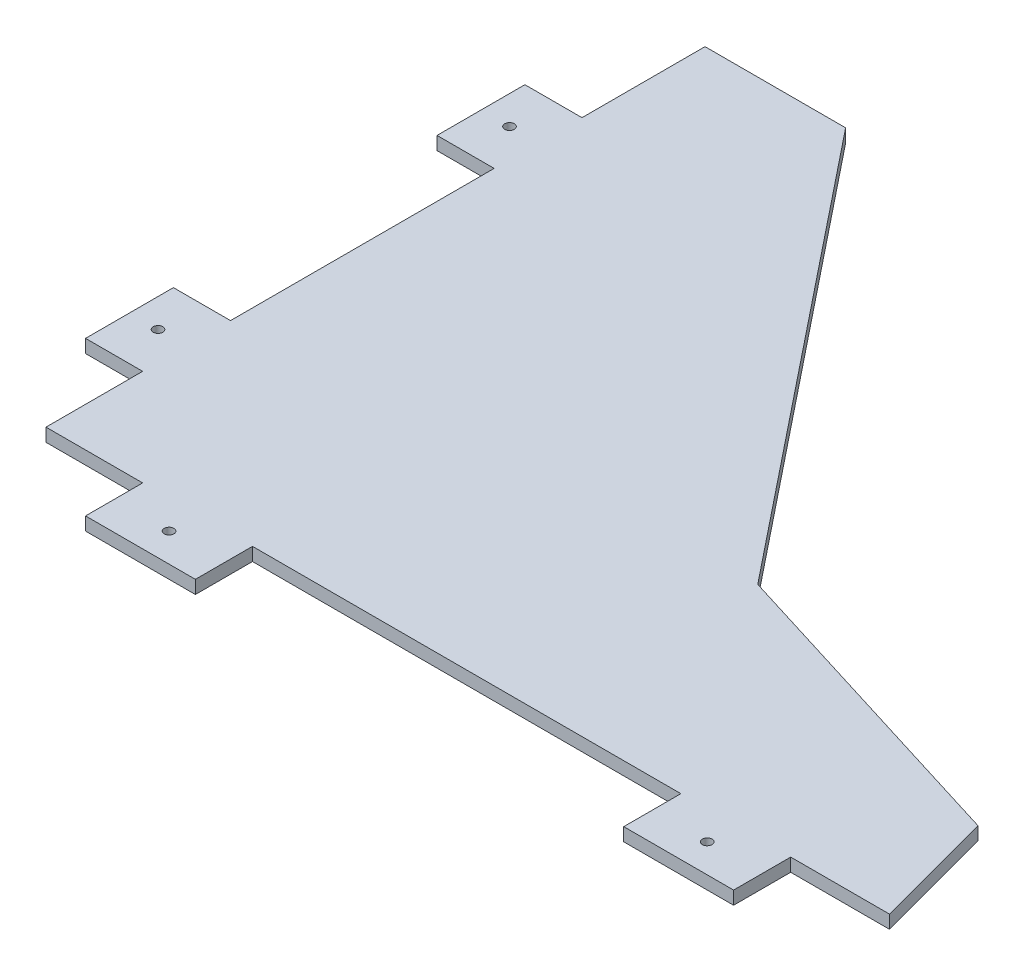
ISO-10303-21;
HEADER;
FILE_DESCRIPTION(('STEP AP214'),'2;1');
FILE_NAME('part.step','',(''),(''),'','','');
FILE_SCHEMA(('AUTOMOTIVE_DESIGN { 1 0 10303 214 1 1 1 1 }'));
ENDSEC;
DATA;
#1=APPLICATION_CONTEXT('core data for automotive mechanical design processes');
#2=APPLICATION_PROTOCOL_DEFINITION('international standard','automotive_design',2000,#1);
#3=PRODUCT_CONTEXT('',#1,'mechanical');
#4=PRODUCT('Part','Part','',(#3));
#5=PRODUCT_RELATED_PRODUCT_CATEGORY('part','',(#4));
#6=PRODUCT_DEFINITION_FORMATION('','',#4);
#7=PRODUCT_DEFINITION_CONTEXT('part definition',#1,'design');
#8=PRODUCT_DEFINITION('design','',#6,#7);
#9=PRODUCT_DEFINITION_SHAPE('','',#8);
#10=(LENGTH_UNIT() NAMED_UNIT(*) SI_UNIT(.MILLI.,.METRE.));
#11=(NAMED_UNIT(*) PLANE_ANGLE_UNIT() SI_UNIT($,.RADIAN.));
#12=(NAMED_UNIT(*) SI_UNIT($,.STERADIAN.) SOLID_ANGLE_UNIT());
#13=UNCERTAINTY_MEASURE_WITH_UNIT(LENGTH_MEASURE(1.E-05),#10,'distance_accuracy_value','');
#14=(GEOMETRIC_REPRESENTATION_CONTEXT(3) GLOBAL_UNCERTAINTY_ASSIGNED_CONTEXT((#13)) GLOBAL_UNIT_ASSIGNED_CONTEXT((#10,
#11,#12)) REPRESENTATION_CONTEXT('',''));
#15=CARTESIAN_POINT('',(0.,0.,0.));
#16=DIRECTION('',(0.,0.,1.));
#17=DIRECTION('',(1.,0.,0.));
#18=AXIS2_PLACEMENT_3D('',#15,#16,#17);
#19=CARTESIAN_POINT('',(0.,6.,0.));
#20=DIRECTION('',(0.,-1.,0.));
#21=DIRECTION('',(0.,0.,-1.));
#22=AXIS2_PLACEMENT_3D('',#19,#20,#21);
#23=PLANE('',#22);
#24=CARTESIAN_POINT('',(-123.,6.,163.));
#25=DIRECTION('',(0.,1.,0.));
#26=DIRECTION('',(0.,0.,1.));
#27=AXIS2_PLACEMENT_3D('',#24,#25,#26);
#28=CIRCLE('',#27,2.2);
#29=CARTESIAN_POINT('',(-123.,6.,165.2));
#30=VERTEX_POINT('',#29);
#31=EDGE_CURVE('E422',#30,#30,#28,.T.);
#32=ORIENTED_EDGE('',*,*,#31,.F.);
#33=EDGE_LOOP('',(#32));
#34=FACE_BOUND('',#33,.T.);
#35=CARTESIAN_POINT('',(-205.,6.,-74.));
#36=DIRECTION('',(0.,1.,0.));
#37=DIRECTION('',(0.,0.,1.));
#38=AXIS2_PLACEMENT_3D('',#35,#36,#37);
#39=CIRCLE('',#38,2.20000000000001);
#40=CARTESIAN_POINT('',(-205.,6.,-71.8));
#41=VERTEX_POINT('',#40);
#42=EDGE_CURVE('E218',#41,#41,#39,.T.);
#43=ORIENTED_EDGE('',*,*,#42,.F.);
#44=EDGE_LOOP('',(#43));
#45=FACE_BOUND('',#44,.T.);
#46=DIRECTION('',(-1.,0.,0.));
#47=VECTOR('',#46,1.);
#48=CARTESIAN_POINT('',(-192.,6.,-150.));
#49=LINE('',#48,#47);
#50=CARTESIAN_POINT('',(-128.,6.,-150.));
#51=VERTEX_POINT('',#50);
#52=CARTESIAN_POINT('',(-192.,6.,-150.));
#53=VERTEX_POINT('',#52);
#54=EDGE_CURVE('E257',#51,#53,#49,.T.);
#55=ORIENTED_EDGE('',*,*,#54,.T.);
#56=DIRECTION('',(0.,0.,1.));
#57=VECTOR('',#56,1.);
#58=CARTESIAN_POINT('',(-192.,6.,-150.));
#59=LINE('',#58,#57);
#60=CARTESIAN_POINT('',(-192.,6.,-94.));
#61=VERTEX_POINT('',#60);
#62=EDGE_CURVE('E135',#53,#61,#59,.T.);
#63=ORIENTED_EDGE('',*,*,#62,.T.);
#64=DIRECTION('',(-1.,0.,0.));
#65=VECTOR('',#64,1.);
#66=CARTESIAN_POINT('',(-192.,6.,-94.));
#67=LINE('',#66,#65);
#68=CARTESIAN_POINT('',(-218.,6.,-94.));
#69=VERTEX_POINT('',#68);
#70=EDGE_CURVE('E314',#61,#69,#67,.T.);
#71=ORIENTED_EDGE('',*,*,#70,.T.);
#72=DIRECTION('',(0.,0.,1.));
#73=VECTOR('',#72,1.);
#74=CARTESIAN_POINT('',(-218.,6.,-54.));
#75=LINE('',#74,#73);
#76=CARTESIAN_POINT('',(-218.,6.,-54.));
#77=VERTEX_POINT('',#76);
#78=EDGE_CURVE('E333',#69,#77,#75,.T.);
#79=ORIENTED_EDGE('',*,*,#78,.T.);
#80=DIRECTION('',(1.,0.,0.));
#81=VECTOR('',#80,1.);
#82=CARTESIAN_POINT('',(-192.,6.,-54.));
#83=LINE('',#82,#81);
#84=CARTESIAN_POINT('',(-192.,6.,-54.));
#85=VERTEX_POINT('',#84);
#86=EDGE_CURVE('E330',#77,#85,#83,.T.);
#87=ORIENTED_EDGE('',*,*,#86,.T.);
#88=DIRECTION('',(0.,0.,1.));
#89=VECTOR('',#88,1.);
#90=CARTESIAN_POINT('',(-192.,6.,-54.));
#91=LINE('',#90,#89);
#92=CARTESIAN_POINT('',(-192.,6.,66.));
#93=VERTEX_POINT('',#92);
#94=EDGE_CURVE('E332',#85,#93,#91,.T.);
#95=ORIENTED_EDGE('',*,*,#94,.T.);
#96=DIRECTION('',(-1.,0.,0.));
#97=VECTOR('',#96,1.);
#98=CARTESIAN_POINT('',(-192.,6.,66.));
#99=LINE('',#98,#97);
#100=CARTESIAN_POINT('',(-218.,6.,66.));
#101=VERTEX_POINT('',#100);
#102=EDGE_CURVE('E335',#93,#101,#99,.T.);
#103=ORIENTED_EDGE('',*,*,#102,.T.);
#104=DIRECTION('',(0.,0.,1.));
#105=VECTOR('',#104,1.);
#106=CARTESIAN_POINT('',(-218.,6.,106.));
#107=LINE('',#106,#105);
#108=CARTESIAN_POINT('',(-218.,6.,106.));
#109=VERTEX_POINT('',#108);
#110=EDGE_CURVE('E341',#101,#109,#107,.T.);
#111=ORIENTED_EDGE('',*,*,#110,.T.);
#112=DIRECTION('',(1.,0.,0.));
#113=VECTOR('',#112,1.);
#114=CARTESIAN_POINT('',(-192.,6.,106.));
#115=LINE('',#114,#113);
#116=CARTESIAN_POINT('',(-192.,6.,106.));
#117=VERTEX_POINT('',#116);
#118=EDGE_CURVE('E343',#109,#117,#115,.T.);
#119=ORIENTED_EDGE('',*,*,#118,.T.);
#120=DIRECTION('',(0.,0.,1.));
#121=VECTOR('',#120,1.);
#122=CARTESIAN_POINT('',(-192.,6.,106.));
#123=LINE('',#122,#121);
#124=CARTESIAN_POINT('',(-192.,6.,150.));
#125=VERTEX_POINT('',#124);
#126=EDGE_CURVE('E345',#117,#125,#123,.T.);
#127=ORIENTED_EDGE('',*,*,#126,.T.);
#128=DIRECTION('',(1.,0.,0.));
#129=VECTOR('',#128,1.);
#130=CARTESIAN_POINT('',(-192.,6.,150.));
#131=LINE('',#130,#129);
#132=CARTESIAN_POINT('',(-148.,6.,150.));
#133=VERTEX_POINT('',#132);
#134=EDGE_CURVE('E347',#125,#133,#131,.T.);
#135=ORIENTED_EDGE('',*,*,#134,.T.);
#136=DIRECTION('',(0.,0.,1.));
#137=VECTOR('',#136,1.);
#138=CARTESIAN_POINT('',(-148.,6.,150.));
#139=LINE('',#138,#137);
#140=CARTESIAN_POINT('',(-148.,6.,176.));
#141=VERTEX_POINT('',#140);
#142=EDGE_CURVE('E349',#133,#141,#139,.T.);
#143=ORIENTED_EDGE('',*,*,#142,.T.);
#144=DIRECTION('',(1.,0.,0.));
#145=VECTOR('',#144,1.);
#146=CARTESIAN_POINT('',(-148.,6.,176.));
#147=LINE('',#146,#145);
#148=CARTESIAN_POINT('',(-98.,6.,176.));
#149=VERTEX_POINT('',#148);
#150=EDGE_CURVE('E351',#141,#149,#147,.T.);
#151=ORIENTED_EDGE('',*,*,#150,.T.);
#152=DIRECTION('',(0.,0.,-1.));
#153=VECTOR('',#152,1.);
#154=CARTESIAN_POINT('',(-98.,6.,150.));
#155=LINE('',#154,#153);
#156=CARTESIAN_POINT('',(-98.,6.,150.));
#157=VERTEX_POINT('',#156);
#158=EDGE_CURVE('E353',#149,#157,#155,.T.);
#159=ORIENTED_EDGE('',*,*,#158,.T.);
#160=DIRECTION('',(1.,0.,0.));
#161=VECTOR('',#160,1.);
#162=CARTESIAN_POINT('',(-98.,6.,150.));
#163=LINE('',#162,#161);
#164=CARTESIAN_POINT('',(97.,6.,150.));
#165=VERTEX_POINT('',#164);
#166=EDGE_CURVE('E355',#157,#165,#163,.T.);
#167=ORIENTED_EDGE('',*,*,#166,.T.);
#168=DIRECTION('',(0.,0.,1.));
#169=VECTOR('',#168,1.);
#170=CARTESIAN_POINT('',(97.,6.,150.));
#171=LINE('',#170,#169);
#172=CARTESIAN_POINT('',(97.,6.,176.));
#173=VERTEX_POINT('',#172);
#174=EDGE_CURVE('E357',#165,#173,#171,.T.);
#175=ORIENTED_EDGE('',*,*,#174,.T.);
#176=DIRECTION('',(1.,0.,0.));
#177=VECTOR('',#176,1.);
#178=CARTESIAN_POINT('',(97.,6.,176.));
#179=LINE('',#178,#177);
#180=CARTESIAN_POINT('',(147.,6.,176.));
#181=VERTEX_POINT('',#180);
#182=EDGE_CURVE('E359',#173,#181,#179,.T.);
#183=ORIENTED_EDGE('',*,*,#182,.T.);
#184=DIRECTION('',(0.,0.,-1.));
#185=VECTOR('',#184,1.);
#186=CARTESIAN_POINT('',(147.,6.,150.));
#187=LINE('',#186,#185);
#188=CARTESIAN_POINT('',(147.,6.,150.));
#189=VERTEX_POINT('',#188);
#190=EDGE_CURVE('E361',#181,#189,#187,.T.);
#191=ORIENTED_EDGE('',*,*,#190,.T.);
#192=DIRECTION('',(1.,0.,0.));
#193=VECTOR('',#192,1.);
#194=CARTESIAN_POINT('',(147.,6.,150.));
#195=LINE('',#194,#193);
#196=CARTESIAN_POINT('',(192.,6.,150.));
#197=VERTEX_POINT('',#196);
#198=EDGE_CURVE('E196',#189,#197,#195,.T.);
#199=ORIENTED_EDGE('',*,*,#198,.T.);
#200=DIRECTION('',(-0.258819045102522,0.,-0.965925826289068));
#201=VECTOR('',#200,1.);
#202=CARTESIAN_POINT('',(177.262794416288,6.,95.));
#203=LINE('',#202,#201);
#204=CARTESIAN_POINT('',(177.262794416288,6.,95.));
#205=VERTEX_POINT('',#204);
#206=EDGE_CURVE('E190',#197,#205,#203,.T.);
#207=ORIENTED_EDGE('',*,*,#206,.T.);
#208=DIRECTION('',(-0.95521582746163,0.,-0.295909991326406));
#209=VECTOR('',#208,1.);
#210=CARTESIAN_POINT('',(32.0000000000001,6.,50.));
#211=LINE('',#210,#209);
#212=CARTESIAN_POINT('',(32.0000000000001,6.,50.));
#213=VERTEX_POINT('',#212);
#214=EDGE_CURVE('E194',#205,#213,#211,.T.);
#215=ORIENTED_EDGE('',*,*,#214,.T.);
#216=DIRECTION('',(-0.624695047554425,0.,-0.78086880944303));
#217=VECTOR('',#216,1.);
#218=CARTESIAN_POINT('',(-128.,6.,-150.));
#219=LINE('',#218,#217);
#220=EDGE_CURVE('E50',#213,#51,#219,.T.);
#221=ORIENTED_EDGE('',*,*,#220,.T.);
#222=EDGE_LOOP('',(#55,#63,#71,#79,#87,#95,#103,#111,#119,#127,#135,#143,#151,#159,#167,#175,
#183,#191,#199,#207,#215,#221));
#223=FACE_BOUND('',#222,.T.);
#224=CARTESIAN_POINT('',(-205.,6.,86.));
#225=DIRECTION('',(0.,1.,0.));
#226=DIRECTION('',(0.,0.,1.));
#227=AXIS2_PLACEMENT_3D('',#224,#225,#226);
#228=CIRCLE('',#227,2.20000000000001);
#229=CARTESIAN_POINT('',(-205.,6.,88.2));
#230=VERTEX_POINT('',#229);
#231=EDGE_CURVE('E428',#230,#230,#228,.T.);
#232=ORIENTED_EDGE('',*,*,#231,.F.);
#233=EDGE_LOOP('',(#232));
#234=FACE_BOUND('',#233,.T.);
#235=CARTESIAN_POINT('',(122.,6.,163.));
#236=DIRECTION('',(0.,1.,0.));
#237=DIRECTION('',(0.,0.,1.));
#238=AXIS2_PLACEMENT_3D('',#235,#236,#237);
#239=CIRCLE('',#238,2.2);
#240=CARTESIAN_POINT('',(122.,6.,165.2));
#241=VERTEX_POINT('',#240);
#242=EDGE_CURVE('E413',#241,#241,#239,.T.);
#243=ORIENTED_EDGE('',*,*,#242,.F.);
#244=EDGE_LOOP('',(#243));
#245=FACE_BOUND('',#244,.T.);
#246=ADVANCED_FACE('F33',(#34,#45,#223,#234,#245),#23,.F.);
#247=CARTESIAN_POINT('',(0.,0.,0.));
#248=DIRECTION('',(0.,-1.,0.));
#249=DIRECTION('',(0.,0.,-1.));
#250=AXIS2_PLACEMENT_3D('',#247,#248,#249);
#251=PLANE('',#250);
#252=CARTESIAN_POINT('',(-123.,0.,163.));
#253=DIRECTION('',(0.,1.,0.));
#254=DIRECTION('',(0.,0.,1.));
#255=AXIS2_PLACEMENT_3D('',#252,#253,#254);
#256=CIRCLE('',#255,2.2);
#257=CARTESIAN_POINT('',(-123.,0.,165.2));
#258=VERTEX_POINT('',#257);
#259=EDGE_CURVE('E419',#258,#258,#256,.T.);
#260=ORIENTED_EDGE('',*,*,#259,.T.);
#261=EDGE_LOOP('',(#260));
#262=FACE_BOUND('',#261,.T.);
#263=CARTESIAN_POINT('',(-205.,0.,-74.));
#264=DIRECTION('',(0.,1.,0.));
#265=DIRECTION('',(0.,0.,1.));
#266=AXIS2_PLACEMENT_3D('',#263,#264,#265);
#267=CIRCLE('',#266,2.20000000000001);
#268=CARTESIAN_POINT('',(-205.,0.,-71.8));
#269=VERTEX_POINT('',#268);
#270=EDGE_CURVE('E431',#269,#269,#267,.T.);
#271=ORIENTED_EDGE('',*,*,#270,.T.);
#272=EDGE_LOOP('',(#271));
#273=FACE_BOUND('',#272,.T.);
#274=DIRECTION('',(-1.,0.,0.));
#275=VECTOR('',#274,1.);
#276=CARTESIAN_POINT('',(-192.,0.,-150.));
#277=LINE('',#276,#275);
#278=CARTESIAN_POINT('',(-128.,0.,-150.));
#279=VERTEX_POINT('',#278);
#280=CARTESIAN_POINT('',(-192.,0.,-150.));
#281=VERTEX_POINT('',#280);
#282=EDGE_CURVE('E214',#279,#281,#277,.T.);
#283=ORIENTED_EDGE('',*,*,#282,.F.);
#284=DIRECTION('',(-0.624695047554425,0.,-0.78086880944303));
#285=VECTOR('',#284,1.);
#286=CARTESIAN_POINT('',(-128.,0.,-150.));
#287=LINE('',#286,#285);
#288=CARTESIAN_POINT('',(32.0000000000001,0.,50.));
#289=VERTEX_POINT('',#288);
#290=EDGE_CURVE('E127',#289,#279,#287,.T.);
#291=ORIENTED_EDGE('',*,*,#290,.F.);
#292=DIRECTION('',(-0.95521582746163,0.,-0.295909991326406));
#293=VECTOR('',#292,1.);
#294=CARTESIAN_POINT('',(32.0000000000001,0.,50.));
#295=LINE('',#294,#293);
#296=CARTESIAN_POINT('',(177.262794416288,0.,95.));
#297=VERTEX_POINT('',#296);
#298=EDGE_CURVE('E121',#297,#289,#295,.T.);
#299=ORIENTED_EDGE('',*,*,#298,.F.);
#300=DIRECTION('',(-0.258819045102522,0.,-0.965925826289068));
#301=VECTOR('',#300,1.);
#302=CARTESIAN_POINT('',(177.262794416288,0.,95.));
#303=LINE('',#302,#301);
#304=CARTESIAN_POINT('',(192.,0.,150.));
#305=VERTEX_POINT('',#304);
#306=EDGE_CURVE('E204',#305,#297,#303,.T.);
#307=ORIENTED_EDGE('',*,*,#306,.F.);
#308=DIRECTION('',(1.,0.,0.));
#309=VECTOR('',#308,1.);
#310=CARTESIAN_POINT('',(147.,0.,150.));
#311=LINE('',#310,#309);
#312=CARTESIAN_POINT('',(147.,0.,150.));
#313=VERTEX_POINT('',#312);
#314=EDGE_CURVE('E252',#313,#305,#311,.T.);
#315=ORIENTED_EDGE('',*,*,#314,.F.);
#316=DIRECTION('',(0.,0.,-1.));
#317=VECTOR('',#316,1.);
#318=CARTESIAN_POINT('',(147.,0.,150.));
#319=LINE('',#318,#317);
#320=CARTESIAN_POINT('',(147.,0.,176.));
#321=VERTEX_POINT('',#320);
#322=EDGE_CURVE('E250',#321,#313,#319,.T.);
#323=ORIENTED_EDGE('',*,*,#322,.F.);
#324=DIRECTION('',(1.,0.,0.));
#325=VECTOR('',#324,1.);
#326=CARTESIAN_POINT('',(97.,0.,176.));
#327=LINE('',#326,#325);
#328=CARTESIAN_POINT('',(97.,0.,176.));
#329=VERTEX_POINT('',#328);
#330=EDGE_CURVE('E248',#329,#321,#327,.T.);
#331=ORIENTED_EDGE('',*,*,#330,.F.);
#332=DIRECTION('',(0.,0.,1.));
#333=VECTOR('',#332,1.);
#334=CARTESIAN_POINT('',(97.,0.,150.));
#335=LINE('',#334,#333);
#336=CARTESIAN_POINT('',(97.,0.,150.));
#337=VERTEX_POINT('',#336);
#338=EDGE_CURVE('E246',#337,#329,#335,.T.);
#339=ORIENTED_EDGE('',*,*,#338,.F.);
#340=DIRECTION('',(1.,0.,0.));
#341=VECTOR('',#340,1.);
#342=CARTESIAN_POINT('',(-98.,0.,150.));
#343=LINE('',#342,#341);
#344=CARTESIAN_POINT('',(-98.,0.,150.));
#345=VERTEX_POINT('',#344);
#346=EDGE_CURVE('E244',#345,#337,#343,.T.);
#347=ORIENTED_EDGE('',*,*,#346,.F.);
#348=DIRECTION('',(0.,0.,-1.));
#349=VECTOR('',#348,1.);
#350=CARTESIAN_POINT('',(-98.,0.,150.));
#351=LINE('',#350,#349);
#352=CARTESIAN_POINT('',(-98.,0.,176.));
#353=VERTEX_POINT('',#352);
#354=EDGE_CURVE('E242',#353,#345,#351,.T.);
#355=ORIENTED_EDGE('',*,*,#354,.F.);
#356=DIRECTION('',(1.,0.,0.));
#357=VECTOR('',#356,1.);
#358=CARTESIAN_POINT('',(-148.,0.,176.));
#359=LINE('',#358,#357);
#360=CARTESIAN_POINT('',(-148.,0.,176.));
#361=VERTEX_POINT('',#360);
#362=EDGE_CURVE('E240',#361,#353,#359,.T.);
#363=ORIENTED_EDGE('',*,*,#362,.F.);
#364=DIRECTION('',(0.,0.,1.));
#365=VECTOR('',#364,1.);
#366=CARTESIAN_POINT('',(-148.,0.,150.));
#367=LINE('',#366,#365);
#368=CARTESIAN_POINT('',(-148.,0.,150.));
#369=VERTEX_POINT('',#368);
#370=EDGE_CURVE('E238',#369,#361,#367,.T.);
#371=ORIENTED_EDGE('',*,*,#370,.F.);
#372=DIRECTION('',(1.,0.,0.));
#373=VECTOR('',#372,1.);
#374=CARTESIAN_POINT('',(-192.,0.,150.));
#375=LINE('',#374,#373);
#376=CARTESIAN_POINT('',(-192.,0.,150.));
#377=VERTEX_POINT('',#376);
#378=EDGE_CURVE('E236',#377,#369,#375,.T.);
#379=ORIENTED_EDGE('',*,*,#378,.F.);
#380=DIRECTION('',(0.,0.,1.));
#381=VECTOR('',#380,1.);
#382=CARTESIAN_POINT('',(-192.,0.,106.));
#383=LINE('',#382,#381);
#384=CARTESIAN_POINT('',(-192.,0.,106.));
#385=VERTEX_POINT('',#384);
#386=EDGE_CURVE('E234',#385,#377,#383,.T.);
#387=ORIENTED_EDGE('',*,*,#386,.F.);
#388=DIRECTION('',(1.,0.,0.));
#389=VECTOR('',#388,1.);
#390=CARTESIAN_POINT('',(-192.,0.,106.));
#391=LINE('',#390,#389);
#392=CARTESIAN_POINT('',(-218.,0.,106.));
#393=VERTEX_POINT('',#392);
#394=EDGE_CURVE('E232',#393,#385,#391,.T.);
#395=ORIENTED_EDGE('',*,*,#394,.F.);
#396=DIRECTION('',(0.,0.,1.));
#397=VECTOR('',#396,1.);
#398=CARTESIAN_POINT('',(-218.,0.,106.));
#399=LINE('',#398,#397);
#400=CARTESIAN_POINT('',(-218.,0.,66.));
#401=VERTEX_POINT('',#400);
#402=EDGE_CURVE('E230',#401,#393,#399,.T.);
#403=ORIENTED_EDGE('',*,*,#402,.F.);
#404=DIRECTION('',(-1.,0.,0.));
#405=VECTOR('',#404,1.);
#406=CARTESIAN_POINT('',(-192.,0.,66.));
#407=LINE('',#406,#405);
#408=CARTESIAN_POINT('',(-192.,0.,66.));
#409=VERTEX_POINT('',#408);
#410=EDGE_CURVE('E228',#409,#401,#407,.T.);
#411=ORIENTED_EDGE('',*,*,#410,.F.);
#412=DIRECTION('',(0.,0.,1.));
#413=VECTOR('',#412,1.);
#414=CARTESIAN_POINT('',(-192.,0.,-54.));
#415=LINE('',#414,#413);
#416=CARTESIAN_POINT('',(-192.,0.,-54.));
#417=VERTEX_POINT('',#416);
#418=EDGE_CURVE('E226',#417,#409,#415,.T.);
#419=ORIENTED_EDGE('',*,*,#418,.F.);
#420=DIRECTION('',(1.,0.,0.));
#421=VECTOR('',#420,1.);
#422=CARTESIAN_POINT('',(-192.,0.,-54.));
#423=LINE('',#422,#421);
#424=CARTESIAN_POINT('',(-218.,0.,-54.));
#425=VERTEX_POINT('',#424);
#426=EDGE_CURVE('E224',#425,#417,#423,.T.);
#427=ORIENTED_EDGE('',*,*,#426,.F.);
#428=DIRECTION('',(0.,0.,1.));
#429=VECTOR('',#428,1.);
#430=CARTESIAN_POINT('',(-218.,0.,-54.));
#431=LINE('',#430,#429);
#432=CARTESIAN_POINT('',(-218.,0.,-94.));
#433=VERTEX_POINT('',#432);
#434=EDGE_CURVE('E222',#433,#425,#431,.T.);
#435=ORIENTED_EDGE('',*,*,#434,.F.);
#436=DIRECTION('',(-1.,0.,0.));
#437=VECTOR('',#436,1.);
#438=CARTESIAN_POINT('',(-192.,0.,-94.));
#439=LINE('',#438,#437);
#440=CARTESIAN_POINT('',(-192.,0.,-94.));
#441=VERTEX_POINT('',#440);
#442=EDGE_CURVE('E220',#441,#433,#439,.T.);
#443=ORIENTED_EDGE('',*,*,#442,.F.);
#444=DIRECTION('',(0.,0.,1.));
#445=VECTOR('',#444,1.);
#446=CARTESIAN_POINT('',(-192.,0.,-150.));
#447=LINE('',#446,#445);
#448=EDGE_CURVE('E217',#281,#441,#447,.T.);
#449=ORIENTED_EDGE('',*,*,#448,.F.);
#450=EDGE_LOOP('',(#283,#291,#299,#307,#315,#323,#331,#339,#347,#355,#363,#371,#379,#387,#395,
#403,#411,#419,#427,#435,#443,#449));
#451=FACE_BOUND('',#450,.T.);
#452=CARTESIAN_POINT('',(-205.,0.,86.));
#453=DIRECTION('',(0.,1.,0.));
#454=DIRECTION('',(0.,0.,1.));
#455=AXIS2_PLACEMENT_3D('',#452,#453,#454);
#456=CIRCLE('',#455,2.20000000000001);
#457=CARTESIAN_POINT('',(-205.,0.,88.2));
#458=VERTEX_POINT('',#457);
#459=EDGE_CURVE('E425',#458,#458,#456,.T.);
#460=ORIENTED_EDGE('',*,*,#459,.T.);
#461=EDGE_LOOP('',(#460));
#462=FACE_BOUND('',#461,.T.);
#463=CARTESIAN_POINT('',(122.,0.,163.));
#464=DIRECTION('',(0.,1.,0.));
#465=DIRECTION('',(0.,0.,1.));
#466=AXIS2_PLACEMENT_3D('',#463,#464,#465);
#467=CIRCLE('',#466,2.2);
#468=CARTESIAN_POINT('',(122.,0.,165.2));
#469=VERTEX_POINT('',#468);
#470=EDGE_CURVE('E416',#469,#469,#467,.T.);
#471=ORIENTED_EDGE('',*,*,#470,.T.);
#472=EDGE_LOOP('',(#471));
#473=FACE_BOUND('',#472,.T.);
#474=ADVANCED_FACE('F318',(#262,#273,#451,#462,#473),#251,.T.);
#475=CARTESIAN_POINT('',(-192.,6.,-150.));
#476=DIRECTION('',(0.,0.,1.));
#477=DIRECTION('',(1.,0.,0.));
#478=AXIS2_PLACEMENT_3D('',#475,#476,#477);
#479=PLANE('',#478);
#480=ORIENTED_EDGE('',*,*,#282,.T.);
#481=DIRECTION('',(0.,-1.,0.));
#482=VECTOR('',#481,1.);
#483=CARTESIAN_POINT('',(-192.,6.,-150.));
#484=LINE('',#483,#482);
#485=EDGE_CURVE('E11',#53,#281,#484,.T.);
#486=ORIENTED_EDGE('',*,*,#485,.F.);
#487=ORIENTED_EDGE('',*,*,#54,.F.);
#488=DIRECTION('',(0.,-1.,0.));
#489=VECTOR('',#488,1.);
#490=CARTESIAN_POINT('',(-128.,6.,-150.));
#491=LINE('',#490,#489);
#492=EDGE_CURVE('E210',#51,#279,#491,.T.);
#493=ORIENTED_EDGE('',*,*,#492,.T.);
#494=EDGE_LOOP('',(#480,#486,#487,#493));
#495=FACE_BOUND('',#494,.T.);
#496=ADVANCED_FACE('F35',(#495),#479,.F.);
#497=CARTESIAN_POINT('',(-192.,6.,-150.));
#498=DIRECTION('',(1.,0.,0.));
#499=DIRECTION('',(0.,0.,-1.));
#500=AXIS2_PLACEMENT_3D('',#497,#498,#499);
#501=PLANE('',#500);
#502=ORIENTED_EDGE('',*,*,#448,.T.);
#503=DIRECTION('',(0.,-1.,0.));
#504=VECTOR('',#503,1.);
#505=CARTESIAN_POINT('',(-192.,6.,-94.));
#506=LINE('',#505,#504);
#507=EDGE_CURVE('E42',#61,#441,#506,.T.);
#508=ORIENTED_EDGE('',*,*,#507,.F.);
#509=ORIENTED_EDGE('',*,*,#62,.F.);
#510=ORIENTED_EDGE('',*,*,#485,.T.);
#511=EDGE_LOOP('',(#502,#508,#509,#510));
#512=FACE_BOUND('',#511,.T.);
#513=ADVANCED_FACE('F640',(#512),#501,.F.);
#514=CARTESIAN_POINT('',(-192.,6.,-94.));
#515=DIRECTION('',(0.,0.,1.));
#516=DIRECTION('',(1.,0.,0.));
#517=AXIS2_PLACEMENT_3D('',#514,#515,#516);
#518=PLANE('',#517);
#519=ORIENTED_EDGE('',*,*,#442,.T.);
#520=DIRECTION('',(0.,-1.,0.));
#521=VECTOR('',#520,1.);
#522=CARTESIAN_POINT('',(-218.,6.,-94.));
#523=LINE('',#522,#521);
#524=EDGE_CURVE('E306',#69,#433,#523,.T.);
#525=ORIENTED_EDGE('',*,*,#524,.F.);
#526=ORIENTED_EDGE('',*,*,#70,.F.);
#527=ORIENTED_EDGE('',*,*,#507,.T.);
#528=EDGE_LOOP('',(#519,#525,#526,#527));
#529=FACE_BOUND('',#528,.T.);
#530=ADVANCED_FACE('F312',(#529),#518,.F.);
#531=CARTESIAN_POINT('',(-218.,6.,-54.));
#532=DIRECTION('',(1.,0.,0.));
#533=DIRECTION('',(0.,0.,-1.));
#534=AXIS2_PLACEMENT_3D('',#531,#532,#533);
#535=PLANE('',#534);
#536=ORIENTED_EDGE('',*,*,#434,.T.);
#537=DIRECTION('',(0.,-1.,0.));
#538=VECTOR('',#537,1.);
#539=CARTESIAN_POINT('',(-218.,6.,-54.));
#540=LINE('',#539,#538);
#541=EDGE_CURVE('E303',#77,#425,#540,.T.);
#542=ORIENTED_EDGE('',*,*,#541,.F.);
#543=ORIENTED_EDGE('',*,*,#78,.F.);
#544=ORIENTED_EDGE('',*,*,#524,.T.);
#545=EDGE_LOOP('',(#536,#542,#543,#544));
#546=FACE_BOUND('',#545,.T.);
#547=ADVANCED_FACE('F324',(#546),#535,.F.);
#548=CARTESIAN_POINT('',(-192.,6.,-54.));
#549=DIRECTION('',(0.,0.,-1.));
#550=DIRECTION('',(-1.,0.,0.));
#551=AXIS2_PLACEMENT_3D('',#548,#549,#550);
#552=PLANE('',#551);
#553=ORIENTED_EDGE('',*,*,#426,.T.);
#554=DIRECTION('',(0.,-1.,0.));
#555=VECTOR('',#554,1.);
#556=CARTESIAN_POINT('',(-192.,6.,-54.));
#557=LINE('',#556,#555);
#558=EDGE_CURVE('E300',#85,#417,#557,.T.);
#559=ORIENTED_EDGE('',*,*,#558,.F.);
#560=ORIENTED_EDGE('',*,*,#86,.F.);
#561=ORIENTED_EDGE('',*,*,#541,.T.);
#562=EDGE_LOOP('',(#553,#559,#560,#561));
#563=FACE_BOUND('',#562,.T.);
#564=ADVANCED_FACE('F328',(#563),#552,.F.);
#565=CARTESIAN_POINT('',(-192.,6.,-54.));
#566=DIRECTION('',(1.,0.,0.));
#567=DIRECTION('',(0.,0.,-1.));
#568=AXIS2_PLACEMENT_3D('',#565,#566,#567);
#569=PLANE('',#568);
#570=ORIENTED_EDGE('',*,*,#418,.T.);
#571=DIRECTION('',(0.,-1.,0.));
#572=VECTOR('',#571,1.);
#573=CARTESIAN_POINT('',(-192.,6.,66.));
#574=LINE('',#573,#572);
#575=EDGE_CURVE('E297',#93,#409,#574,.T.);
#576=ORIENTED_EDGE('',*,*,#575,.F.);
#577=ORIENTED_EDGE('',*,*,#94,.F.);
#578=ORIENTED_EDGE('',*,*,#558,.T.);
#579=EDGE_LOOP('',(#570,#576,#577,#578));
#580=FACE_BOUND('',#579,.T.);
#581=ADVANCED_FACE('F605',(#580),#569,.F.);
#582=CARTESIAN_POINT('',(-192.,6.,66.));
#583=DIRECTION('',(0.,0.,1.));
#584=DIRECTION('',(1.,0.,0.));
#585=AXIS2_PLACEMENT_3D('',#582,#583,#584);
#586=PLANE('',#585);
#587=ORIENTED_EDGE('',*,*,#410,.T.);
#588=DIRECTION('',(0.,-1.,0.));
#589=VECTOR('',#588,1.);
#590=CARTESIAN_POINT('',(-218.,6.,66.));
#591=LINE('',#590,#589);
#592=EDGE_CURVE('E294',#101,#401,#591,.T.);
#593=ORIENTED_EDGE('',*,*,#592,.F.);
#594=ORIENTED_EDGE('',*,*,#102,.F.);
#595=ORIENTED_EDGE('',*,*,#575,.T.);
#596=EDGE_LOOP('',(#587,#593,#594,#595));
#597=FACE_BOUND('',#596,.T.);
#598=ADVANCED_FACE('F595',(#597),#586,.F.);
#599=CARTESIAN_POINT('',(-218.,6.,106.));
#600=DIRECTION('',(1.,0.,0.));
#601=DIRECTION('',(0.,0.,-1.));
#602=AXIS2_PLACEMENT_3D('',#599,#600,#601);
#603=PLANE('',#602);
#604=ORIENTED_EDGE('',*,*,#402,.T.);
#605=DIRECTION('',(0.,-1.,0.));
#606=VECTOR('',#605,1.);
#607=CARTESIAN_POINT('',(-218.,6.,106.));
#608=LINE('',#607,#606);
#609=EDGE_CURVE('E291',#109,#393,#608,.T.);
#610=ORIENTED_EDGE('',*,*,#609,.F.);
#611=ORIENTED_EDGE('',*,*,#110,.F.);
#612=ORIENTED_EDGE('',*,*,#592,.T.);
#613=EDGE_LOOP('',(#604,#610,#611,#612));
#614=FACE_BOUND('',#613,.T.);
#615=ADVANCED_FACE('F585',(#614),#603,.F.);
#616=CARTESIAN_POINT('',(-192.,6.,106.));
#617=DIRECTION('',(0.,0.,-1.));
#618=DIRECTION('',(-1.,0.,0.));
#619=AXIS2_PLACEMENT_3D('',#616,#617,#618);
#620=PLANE('',#619);
#621=ORIENTED_EDGE('',*,*,#394,.T.);
#622=DIRECTION('',(0.,-1.,0.));
#623=VECTOR('',#622,1.);
#624=CARTESIAN_POINT('',(-192.,6.,106.));
#625=LINE('',#624,#623);
#626=EDGE_CURVE('E288',#117,#385,#625,.T.);
#627=ORIENTED_EDGE('',*,*,#626,.F.);
#628=ORIENTED_EDGE('',*,*,#118,.F.);
#629=ORIENTED_EDGE('',*,*,#609,.T.);
#630=EDGE_LOOP('',(#621,#627,#628,#629));
#631=FACE_BOUND('',#630,.T.);
#632=ADVANCED_FACE('F575',(#631),#620,.F.);
#633=CARTESIAN_POINT('',(-192.,6.,106.));
#634=DIRECTION('',(1.,0.,0.));
#635=DIRECTION('',(0.,0.,-1.));
#636=AXIS2_PLACEMENT_3D('',#633,#634,#635);
#637=PLANE('',#636);
#638=ORIENTED_EDGE('',*,*,#386,.T.);
#639=DIRECTION('',(0.,-1.,0.));
#640=VECTOR('',#639,1.);
#641=CARTESIAN_POINT('',(-192.,6.,150.));
#642=LINE('',#641,#640);
#643=EDGE_CURVE('E285',#125,#377,#642,.T.);
#644=ORIENTED_EDGE('',*,*,#643,.F.);
#645=ORIENTED_EDGE('',*,*,#126,.F.);
#646=ORIENTED_EDGE('',*,*,#626,.T.);
#647=EDGE_LOOP('',(#638,#644,#645,#646));
#648=FACE_BOUND('',#647,.T.);
#649=ADVANCED_FACE('F565',(#648),#637,.F.);
#650=CARTESIAN_POINT('',(-192.,6.,150.));
#651=DIRECTION('',(0.,0.,-1.));
#652=DIRECTION('',(-1.,0.,0.));
#653=AXIS2_PLACEMENT_3D('',#650,#651,#652);
#654=PLANE('',#653);
#655=ORIENTED_EDGE('',*,*,#378,.T.);
#656=DIRECTION('',(0.,-1.,0.));
#657=VECTOR('',#656,1.);
#658=CARTESIAN_POINT('',(-148.,6.,150.));
#659=LINE('',#658,#657);
#660=EDGE_CURVE('E282',#133,#369,#659,.T.);
#661=ORIENTED_EDGE('',*,*,#660,.F.);
#662=ORIENTED_EDGE('',*,*,#134,.F.);
#663=ORIENTED_EDGE('',*,*,#643,.T.);
#664=EDGE_LOOP('',(#655,#661,#662,#663));
#665=FACE_BOUND('',#664,.T.);
#666=ADVANCED_FACE('F555',(#665),#654,.F.);
#667=CARTESIAN_POINT('',(-148.,6.,150.));
#668=DIRECTION('',(1.,0.,0.));
#669=DIRECTION('',(0.,0.,-1.));
#670=AXIS2_PLACEMENT_3D('',#667,#668,#669);
#671=PLANE('',#670);
#672=ORIENTED_EDGE('',*,*,#370,.T.);
#673=DIRECTION('',(0.,-1.,0.));
#674=VECTOR('',#673,1.);
#675=CARTESIAN_POINT('',(-148.,6.,176.));
#676=LINE('',#675,#674);
#677=EDGE_CURVE('E279',#141,#361,#676,.T.);
#678=ORIENTED_EDGE('',*,*,#677,.F.);
#679=ORIENTED_EDGE('',*,*,#142,.F.);
#680=ORIENTED_EDGE('',*,*,#660,.T.);
#681=EDGE_LOOP('',(#672,#678,#679,#680));
#682=FACE_BOUND('',#681,.T.);
#683=ADVANCED_FACE('F545',(#682),#671,.F.);
#684=CARTESIAN_POINT('',(-148.,6.,176.));
#685=DIRECTION('',(0.,0.,-1.));
#686=DIRECTION('',(-1.,0.,0.));
#687=AXIS2_PLACEMENT_3D('',#684,#685,#686);
#688=PLANE('',#687);
#689=ORIENTED_EDGE('',*,*,#362,.T.);
#690=DIRECTION('',(0.,-1.,0.));
#691=VECTOR('',#690,1.);
#692=CARTESIAN_POINT('',(-98.,6.,176.));
#693=LINE('',#692,#691);
#694=EDGE_CURVE('E276',#149,#353,#693,.T.);
#695=ORIENTED_EDGE('',*,*,#694,.F.);
#696=ORIENTED_EDGE('',*,*,#150,.F.);
#697=ORIENTED_EDGE('',*,*,#677,.T.);
#698=EDGE_LOOP('',(#689,#695,#696,#697));
#699=FACE_BOUND('',#698,.T.);
#700=ADVANCED_FACE('F535',(#699),#688,.F.);
#701=CARTESIAN_POINT('',(-98.,6.,150.));
#702=DIRECTION('',(-1.,0.,0.));
#703=DIRECTION('',(0.,0.,1.));
#704=AXIS2_PLACEMENT_3D('',#701,#702,#703);
#705=PLANE('',#704);
#706=ORIENTED_EDGE('',*,*,#354,.T.);
#707=DIRECTION('',(0.,-1.,0.));
#708=VECTOR('',#707,1.);
#709=CARTESIAN_POINT('',(-98.,6.,150.));
#710=LINE('',#709,#708);
#711=EDGE_CURVE('E273',#157,#345,#710,.T.);
#712=ORIENTED_EDGE('',*,*,#711,.F.);
#713=ORIENTED_EDGE('',*,*,#158,.F.);
#714=ORIENTED_EDGE('',*,*,#694,.T.);
#715=EDGE_LOOP('',(#706,#712,#713,#714));
#716=FACE_BOUND('',#715,.T.);
#717=ADVANCED_FACE('F525',(#716),#705,.F.);
#718=CARTESIAN_POINT('',(-98.,6.,150.));
#719=DIRECTION('',(0.,0.,-1.));
#720=DIRECTION('',(-1.,0.,0.));
#721=AXIS2_PLACEMENT_3D('',#718,#719,#720);
#722=PLANE('',#721);
#723=ORIENTED_EDGE('',*,*,#346,.T.);
#724=DIRECTION('',(0.,-1.,0.));
#725=VECTOR('',#724,1.);
#726=CARTESIAN_POINT('',(97.,6.,150.));
#727=LINE('',#726,#725);
#728=EDGE_CURVE('E270',#165,#337,#727,.T.);
#729=ORIENTED_EDGE('',*,*,#728,.F.);
#730=ORIENTED_EDGE('',*,*,#166,.F.);
#731=ORIENTED_EDGE('',*,*,#711,.T.);
#732=EDGE_LOOP('',(#723,#729,#730,#731));
#733=FACE_BOUND('',#732,.T.);
#734=ADVANCED_FACE('F515',(#733),#722,.F.);
#735=CARTESIAN_POINT('',(97.,6.,150.));
#736=DIRECTION('',(1.,0.,0.));
#737=DIRECTION('',(0.,0.,-1.));
#738=AXIS2_PLACEMENT_3D('',#735,#736,#737);
#739=PLANE('',#738);
#740=ORIENTED_EDGE('',*,*,#338,.T.);
#741=DIRECTION('',(0.,-1.,0.));
#742=VECTOR('',#741,1.);
#743=CARTESIAN_POINT('',(97.,6.,176.));
#744=LINE('',#743,#742);
#745=EDGE_CURVE('E267',#173,#329,#744,.T.);
#746=ORIENTED_EDGE('',*,*,#745,.F.);
#747=ORIENTED_EDGE('',*,*,#174,.F.);
#748=ORIENTED_EDGE('',*,*,#728,.T.);
#749=EDGE_LOOP('',(#740,#746,#747,#748));
#750=FACE_BOUND('',#749,.T.);
#751=ADVANCED_FACE('F505',(#750),#739,.F.);
#752=CARTESIAN_POINT('',(97.,6.,176.));
#753=DIRECTION('',(0.,0.,-1.));
#754=DIRECTION('',(-1.,0.,0.));
#755=AXIS2_PLACEMENT_3D('',#752,#753,#754);
#756=PLANE('',#755);
#757=ORIENTED_EDGE('',*,*,#330,.T.);
#758=DIRECTION('',(0.,-1.,0.));
#759=VECTOR('',#758,1.);
#760=CARTESIAN_POINT('',(147.,6.,176.));
#761=LINE('',#760,#759);
#762=EDGE_CURVE('E264',#181,#321,#761,.T.);
#763=ORIENTED_EDGE('',*,*,#762,.F.);
#764=ORIENTED_EDGE('',*,*,#182,.F.);
#765=ORIENTED_EDGE('',*,*,#745,.T.);
#766=EDGE_LOOP('',(#757,#763,#764,#765));
#767=FACE_BOUND('',#766,.T.);
#768=ADVANCED_FACE('F496',(#767),#756,.F.);
#769=CARTESIAN_POINT('',(147.,6.,150.));
#770=DIRECTION('',(-1.,0.,0.));
#771=DIRECTION('',(0.,0.,1.));
#772=AXIS2_PLACEMENT_3D('',#769,#770,#771);
#773=PLANE('',#772);
#774=ORIENTED_EDGE('',*,*,#322,.T.);
#775=DIRECTION('',(0.,-1.,0.));
#776=VECTOR('',#775,1.);
#777=CARTESIAN_POINT('',(147.,6.,150.));
#778=LINE('',#777,#776);
#779=EDGE_CURVE('E261',#189,#313,#778,.T.);
#780=ORIENTED_EDGE('',*,*,#779,.F.);
#781=ORIENTED_EDGE('',*,*,#190,.F.);
#782=ORIENTED_EDGE('',*,*,#762,.T.);
#783=EDGE_LOOP('',(#774,#780,#781,#782));
#784=FACE_BOUND('',#783,.T.);
#785=ADVANCED_FACE('F367',(#784),#773,.F.);
#786=CARTESIAN_POINT('',(147.,6.,150.));
#787=DIRECTION('',(0.,0.,-1.));
#788=DIRECTION('',(-1.,0.,0.));
#789=AXIS2_PLACEMENT_3D('',#786,#787,#788);
#790=PLANE('',#789);
#791=ORIENTED_EDGE('',*,*,#314,.T.);
#792=DIRECTION('',(0.,-1.,0.));
#793=VECTOR('',#792,1.);
#794=CARTESIAN_POINT('',(192.,6.,150.));
#795=LINE('',#794,#793);
#796=EDGE_CURVE('E205',#197,#305,#795,.T.);
#797=ORIENTED_EDGE('',*,*,#796,.F.);
#798=ORIENTED_EDGE('',*,*,#198,.F.);
#799=ORIENTED_EDGE('',*,*,#779,.T.);
#800=EDGE_LOOP('',(#791,#797,#798,#799));
#801=FACE_BOUND('',#800,.T.);
#802=ADVANCED_FACE('F371',(#801),#790,.F.);
#803=CARTESIAN_POINT('',(177.262794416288,6.,95.));
#804=DIRECTION('',(-0.965925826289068,0.,0.258819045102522));
#805=DIRECTION('',(0.258819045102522,0.,0.965925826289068));
#806=AXIS2_PLACEMENT_3D('',#803,#804,#805);
#807=PLANE('',#806);
#808=ORIENTED_EDGE('',*,*,#306,.T.);
#809=DIRECTION('',(0.,-1.,0.));
#810=VECTOR('',#809,1.);
#811=CARTESIAN_POINT('',(177.262794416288,6.,95.));
#812=LINE('',#811,#810);
#813=EDGE_CURVE('E201',#205,#297,#812,.T.);
#814=ORIENTED_EDGE('',*,*,#813,.F.);
#815=ORIENTED_EDGE('',*,*,#206,.F.);
#816=ORIENTED_EDGE('',*,*,#796,.T.);
#817=EDGE_LOOP('',(#808,#814,#815,#816));
#818=FACE_BOUND('',#817,.T.);
#819=ADVANCED_FACE('F202',(#818),#807,.F.);
#820=CARTESIAN_POINT('',(32.0000000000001,6.,50.));
#821=DIRECTION('',(-0.295909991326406,0.,0.95521582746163));
#822=DIRECTION('',(0.95521582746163,0.,0.295909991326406));
#823=AXIS2_PLACEMENT_3D('',#820,#821,#822);
#824=PLANE('',#823);
#825=ORIENTED_EDGE('',*,*,#298,.T.);
#826=DIRECTION('',(0.,-1.,0.));
#827=VECTOR('',#826,1.);
#828=CARTESIAN_POINT('',(32.0000000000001,6.,50.));
#829=LINE('',#828,#827);
#830=EDGE_CURVE('E206',#213,#289,#829,.T.);
#831=ORIENTED_EDGE('',*,*,#830,.F.);
#832=ORIENTED_EDGE('',*,*,#214,.F.);
#833=ORIENTED_EDGE('',*,*,#813,.T.);
#834=EDGE_LOOP('',(#825,#831,#832,#833));
#835=FACE_BOUND('',#834,.T.);
#836=ADVANCED_FACE('F208',(#835),#824,.F.);
#837=CARTESIAN_POINT('',(-128.,6.,-150.));
#838=DIRECTION('',(-0.78086880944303,0.,0.624695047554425));
#839=DIRECTION('',(0.624695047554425,0.,0.78086880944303));
#840=AXIS2_PLACEMENT_3D('',#837,#838,#839);
#841=PLANE('',#840);
#842=ORIENTED_EDGE('',*,*,#290,.T.);
#843=ORIENTED_EDGE('',*,*,#492,.F.);
#844=ORIENTED_EDGE('',*,*,#220,.F.);
#845=ORIENTED_EDGE('',*,*,#830,.T.);
#846=EDGE_LOOP('',(#842,#843,#844,#845));
#847=FACE_BOUND('',#846,.T.);
#848=ADVANCED_FACE('F375',(#847),#841,.F.);
#849=CARTESIAN_POINT('',(-205.,6.,-74.));
#850=DIRECTION('',(0.,-1.,0.));
#851=DIRECTION('',(0.,0.,-1.));
#852=AXIS2_PLACEMENT_3D('',#849,#850,#851);
#853=CYLINDRICAL_SURFACE('',#852,2.20000000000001);
#854=ORIENTED_EDGE('',*,*,#42,.T.);
#855=EDGE_LOOP('',(#854));
#856=FACE_BOUND('',#855,.T.);
#857=ORIENTED_EDGE('',*,*,#270,.F.);
#858=EDGE_LOOP('',(#857));
#859=FACE_BOUND('',#858,.T.);
#860=ADVANCED_FACE('F377',(#856,#859),#853,.F.);
#861=CARTESIAN_POINT('',(-205.,6.,86.));
#862=DIRECTION('',(0.,-1.,0.));
#863=DIRECTION('',(0.,0.,-1.));
#864=AXIS2_PLACEMENT_3D('',#861,#862,#863);
#865=CYLINDRICAL_SURFACE('',#864,2.20000000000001);
#866=ORIENTED_EDGE('',*,*,#231,.T.);
#867=EDGE_LOOP('',(#866));
#868=FACE_BOUND('',#867,.T.);
#869=ORIENTED_EDGE('',*,*,#459,.F.);
#870=EDGE_LOOP('',(#869));
#871=FACE_BOUND('',#870,.T.);
#872=ADVANCED_FACE('F383',(#868,#871),#865,.F.);
#873=CARTESIAN_POINT('',(-123.,6.,163.));
#874=DIRECTION('',(0.,-1.,0.));
#875=DIRECTION('',(0.,0.,-1.));
#876=AXIS2_PLACEMENT_3D('',#873,#874,#875);
#877=CYLINDRICAL_SURFACE('',#876,2.2);
#878=ORIENTED_EDGE('',*,*,#31,.T.);
#879=EDGE_LOOP('',(#878));
#880=FACE_BOUND('',#879,.T.);
#881=ORIENTED_EDGE('',*,*,#259,.F.);
#882=EDGE_LOOP('',(#881));
#883=FACE_BOUND('',#882,.T.);
#884=ADVANCED_FACE('F400',(#880,#883),#877,.F.);
#885=CARTESIAN_POINT('',(122.,6.,163.));
#886=DIRECTION('',(0.,-1.,0.));
#887=DIRECTION('',(0.,0.,-1.));
#888=AXIS2_PLACEMENT_3D('',#885,#886,#887);
#889=CYLINDRICAL_SURFACE('',#888,2.2);
#890=ORIENTED_EDGE('',*,*,#242,.T.);
#891=EDGE_LOOP('',(#890));
#892=FACE_BOUND('',#891,.T.);
#893=ORIENTED_EDGE('',*,*,#470,.F.);
#894=EDGE_LOOP('',(#893));
#895=FACE_BOUND('',#894,.T.);
#896=ADVANCED_FACE('F404',(#892,#895),#889,.F.);
#897=CLOSED_SHELL('',(#246,#474,#496,#513,#530,#547,#564,#581,#598,#615,#632,#649,#666,#683,
#700,#717,#734,#751,#768,#785,#802,#819,#836,#848,#860,#872,#884,#896));
#898=MANIFOLD_SOLID_BREP('B2',#897);
#899=ADVANCED_BREP_SHAPE_REPRESENTATION('',(#18,#898),#14);
#900=SHAPE_DEFINITION_REPRESENTATION(#9,#899);
ENDSEC;
END-ISO-10303-21;
